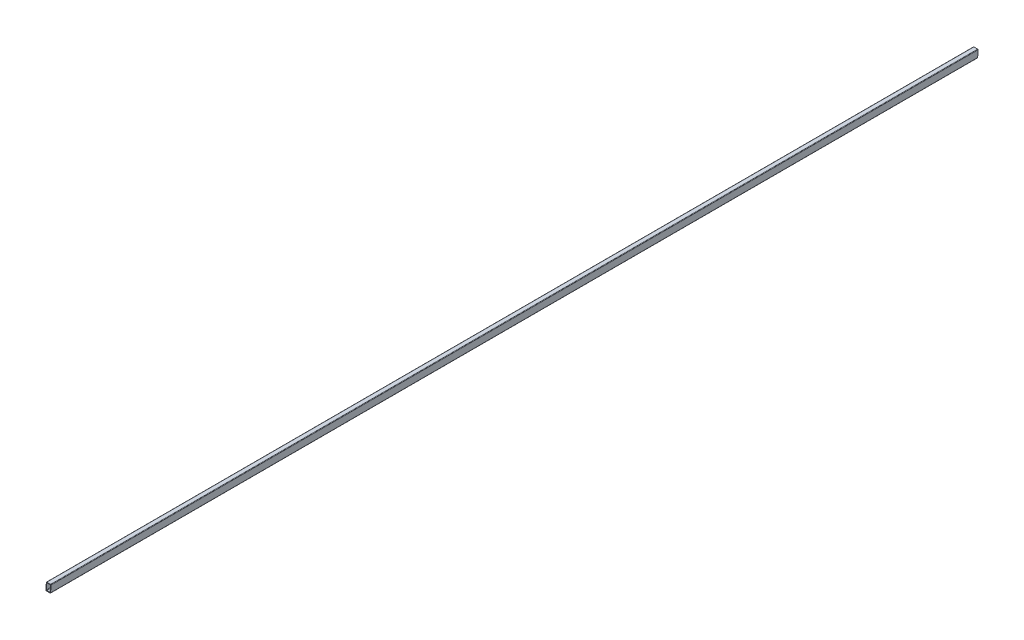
from build123d import *

# Parameters (mm, degrees)
ESQUISSE1_W             = 50
ESQUISSE1_H             = 80
ESQUISSE1_W_2           = 40
ESQUISSE1_H_2           = 70
BOSS_EXTRU_1_DEPTH      = 10200
ENL_V_MAT_EXTRU_1_DEPTH = 10201.200978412
CONG_1_R                = 5
ENL_V_MAT_EXTRU_2_DEPTH = 10201.200978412


with BuildPart() as part:
    # Esquisse1 → Boss.-Extru.1 (new body)
    with BuildSketch(Plane.XY):
        Rectangle(ESQUISSE1_W, ESQUISSE1_H)
        Rectangle(ESQUISSE1_W_2, ESQUISSE1_H_2, mode=Mode.SUBTRACT)
    extrude(amount=BOSS_EXTRU_1_DEPTH)

    # Esquisse2 → Enl_v. mat.-Extru.1 (cut, through all)
    with BuildSketch(Plane(origin=(25, 0, 0), x_dir=(0, 0, -1), z_dir=(1, 0, 0))):
        Polygon((0, 40), (-5.39594127, -67.919022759), (70.302798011, -76.625182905), (74.961637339, 49.163478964), align=None)
    extrude(amount=-ENL_V_MAT_EXTRU_1_DEPTH, mode=Mode.SUBTRACT)

    # Cong_1
    cong_1_edges = [part.edges().sort_by_distance(p)[0] for p in [
        (-20, 35, 5100.124999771),
        (-20, -35, 5101.874996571),
        (20, -35, 5101.874996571),
        (20, 35, 5100.124999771),
        (-25, 40, 5100),
        (25, 40, 5100),
        (25, -40, 5101.999996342),
        (-25, -40, 5101.999996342),
    ]]
    fillet(cong_1_edges, radius=CONG_1_R)

    # Esquisse3 → Enl_v. mat.-Extru.2 (cut, through all)
    with BuildSketch(Plane(origin=(25, 0, 0), x_dir=(0, 0, -1), z_dir=(1, 0, 0))):
        Polygon((-10012.49, 40), (-10017.816601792, -66.532230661), (-10226.996042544, -66.532230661), (-10226.996042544, 77.733134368), (-10012.49, 77.733134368), align=None)
    extrude(amount=-ENL_V_MAT_EXTRU_2_DEPTH, mode=Mode.SUBTRACT)


solid = part.part
